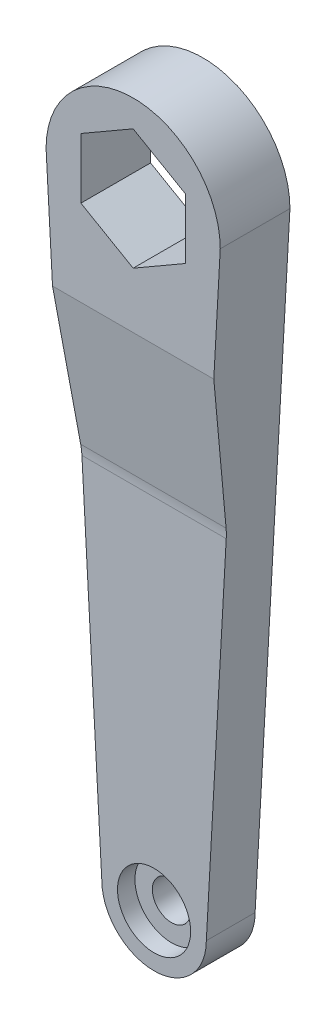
ISO-10303-21;
HEADER;
FILE_DESCRIPTION(('STEP AP214'),'2;1');
FILE_NAME('part.step','',(''),(''),'','','');
FILE_SCHEMA(('AUTOMOTIVE_DESIGN { 1 0 10303 214 1 1 1 1 }'));
ENDSEC;
DATA;
#1=APPLICATION_CONTEXT('core data for automotive mechanical design processes');
#2=APPLICATION_PROTOCOL_DEFINITION('international standard','automotive_design',2000,#1);
#3=PRODUCT_CONTEXT('',#1,'mechanical');
#4=PRODUCT('Part','Part','',(#3));
#5=PRODUCT_RELATED_PRODUCT_CATEGORY('part','',(#4));
#6=PRODUCT_DEFINITION_FORMATION('','',#4);
#7=PRODUCT_DEFINITION_CONTEXT('part definition',#1,'design');
#8=PRODUCT_DEFINITION('design','',#6,#7);
#9=PRODUCT_DEFINITION_SHAPE('','',#8);
#10=(LENGTH_UNIT() NAMED_UNIT(*) SI_UNIT(.MILLI.,.METRE.));
#11=(NAMED_UNIT(*) PLANE_ANGLE_UNIT() SI_UNIT($,.RADIAN.));
#12=(NAMED_UNIT(*) SI_UNIT($,.STERADIAN.) SOLID_ANGLE_UNIT());
#13=UNCERTAINTY_MEASURE_WITH_UNIT(LENGTH_MEASURE(1.E-05),#10,'distance_accuracy_value','');
#14=(GEOMETRIC_REPRESENTATION_CONTEXT(3) GLOBAL_UNCERTAINTY_ASSIGNED_CONTEXT((#13)) GLOBAL_UNIT_ASSIGNED_CONTEXT((#10,
#11,#12)) REPRESENTATION_CONTEXT('',''));
#15=CARTESIAN_POINT('',(0.,0.,0.));
#16=DIRECTION('',(0.,0.,1.));
#17=DIRECTION('',(1.,0.,0.));
#18=AXIS2_PLACEMENT_3D('',#15,#16,#17);
#19=CARTESIAN_POINT('',(0.,-90.,10.));
#20=DIRECTION('',(0.,0.,-1.));
#21=DIRECTION('',(-1.,0.,0.));
#22=AXIS2_PLACEMENT_3D('',#19,#20,#21);
#23=CYLINDRICAL_SURFACE('',#22,2.75);
#24=CARTESIAN_POINT('',(0.,-90.,0.));
#25=DIRECTION('',(0.,0.,1.));
#26=DIRECTION('',(1.,0.,0.));
#27=AXIS2_PLACEMENT_3D('',#24,#25,#26);
#28=CIRCLE('',#27,2.75);
#29=CARTESIAN_POINT('',(2.75,-90.,0.));
#30=VERTEX_POINT('',#29);
#31=EDGE_CURVE('E227',#30,#30,#28,.T.);
#32=ORIENTED_EDGE('',*,*,#31,.F.);
#33=EDGE_LOOP('',(#32));
#34=FACE_BOUND('',#33,.T.);
#35=CARTESIAN_POINT('',(0.,-90.,4.5));
#36=DIRECTION('',(0.,0.,1.));
#37=DIRECTION('',(1.,0.,0.));
#38=AXIS2_PLACEMENT_3D('',#35,#36,#37);
#39=CIRCLE('',#38,2.75);
#40=CARTESIAN_POINT('',(2.75,-90.,4.5));
#41=VERTEX_POINT('',#40);
#42=EDGE_CURVE('E37',#41,#41,#39,.T.);
#43=ORIENTED_EDGE('',*,*,#42,.T.);
#44=EDGE_LOOP('',(#43));
#45=FACE_BOUND('',#44,.T.);
#46=ADVANCED_FACE('F33',(#34,#45),#23,.F.);
#47=CARTESIAN_POINT('',(0.,0.,10.));
#48=DIRECTION('',(0.,0.,1.));
#49=DIRECTION('',(1.,0.,0.));
#50=AXIS2_PLACEMENT_3D('',#47,#48,#49);
#51=PLANE('',#50);
#52=DIRECTION('',(-1.,0.,0.));
#53=VECTOR('',#52,1.);
#54=CARTESIAN_POINT('',(0.,-16.6609919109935,10.));
#55=LINE('',#54,#53);
#56=CARTESIAN_POINT('',(11.5743893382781,-16.6609919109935,10.));
#57=VERTEX_POINT('',#56);
#58=CARTESIAN_POINT('',(-11.5743893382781,-16.6609919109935,10.));
#59=VERTEX_POINT('',#58);
#60=EDGE_CURVE('E133',#57,#59,#55,.T.);
#61=ORIENTED_EDGE('',*,*,#60,.F.);
#62=DIRECTION('',(0.0554700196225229,0.998460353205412,0.));
#63=VECTOR('',#62,1.);
#64=CARTESIAN_POINT('',(12.5,0.,10.));
#65=LINE('',#64,#63);
#66=CARTESIAN_POINT('',(12.5,0.,10.));
#67=VERTEX_POINT('',#66);
#68=EDGE_CURVE('E171',#57,#67,#65,.T.);
#69=ORIENTED_EDGE('',*,*,#68,.T.);
#70=CARTESIAN_POINT('',(0.,0.,10.));
#71=DIRECTION('',(0.,0.,1.));
#72=DIRECTION('',(1.,0.,0.));
#73=AXIS2_PLACEMENT_3D('',#70,#71,#72);
#74=CIRCLE('',#73,12.5);
#75=CARTESIAN_POINT('',(-12.5,0.,10.));
#76=VERTEX_POINT('',#75);
#77=EDGE_CURVE('E179',#67,#76,#74,.T.);
#78=ORIENTED_EDGE('',*,*,#77,.T.);
#79=DIRECTION('',(0.0554700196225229,-0.998460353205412,0.));
#80=VECTOR('',#79,1.);
#81=CARTESIAN_POINT('',(-12.5,0.,10.));
#82=LINE('',#81,#80);
#83=EDGE_CURVE('E176',#76,#59,#82,.T.);
#84=ORIENTED_EDGE('',*,*,#83,.T.);
#85=EDGE_LOOP('',(#61,#69,#78,#84));
#86=FACE_BOUND('',#85,.T.);
#87=DIRECTION('',(-0.866025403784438,0.5,0.));
#88=VECTOR('',#87,1.);
#89=CARTESIAN_POINT('',(7.49999999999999,4.33012701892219,10.));
#90=LINE('',#89,#88);
#91=CARTESIAN_POINT('',(7.49999999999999,4.33012701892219,10.));
#92=VERTEX_POINT('',#91);
#93=CARTESIAN_POINT('',(0.,8.66025403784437,10.));
#94=VERTEX_POINT('',#93);
#95=EDGE_CURVE('E236',#92,#94,#90,.T.);
#96=ORIENTED_EDGE('',*,*,#95,.F.);
#97=DIRECTION('',(0.,1.,0.));
#98=VECTOR('',#97,1.);
#99=CARTESIAN_POINT('',(7.49999999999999,-4.33012701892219,10.));
#100=LINE('',#99,#98);
#101=CARTESIAN_POINT('',(7.49999999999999,-4.33012701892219,10.));
#102=VERTEX_POINT('',#101);
#103=EDGE_CURVE('E211',#102,#92,#100,.T.);
#104=ORIENTED_EDGE('',*,*,#103,.F.);
#105=DIRECTION('',(0.866025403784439,0.5,0.));
#106=VECTOR('',#105,1.);
#107=CARTESIAN_POINT('',(0.,-8.66025403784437,10.));
#108=LINE('',#107,#106);
#109=CARTESIAN_POINT('',(0.,-8.66025403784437,10.));
#110=VERTEX_POINT('',#109);
#111=EDGE_CURVE('E207',#110,#102,#108,.T.);
#112=ORIENTED_EDGE('',*,*,#111,.F.);
#113=DIRECTION('',(0.866025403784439,-0.5,0.));
#114=VECTOR('',#113,1.);
#115=CARTESIAN_POINT('',(-7.49999999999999,-4.33012701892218,10.));
#116=LINE('',#115,#114);
#117=CARTESIAN_POINT('',(-7.49999999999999,-4.33012701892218,10.));
#118=VERTEX_POINT('',#117);
#119=EDGE_CURVE('E229',#118,#110,#116,.T.);
#120=ORIENTED_EDGE('',*,*,#119,.F.);
#121=DIRECTION('',(0.,-1.,0.));
#122=VECTOR('',#121,1.);
#123=CARTESIAN_POINT('',(-7.49999999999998,4.33012701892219,10.));
#124=LINE('',#123,#122);
#125=CARTESIAN_POINT('',(-7.49999999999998,4.33012701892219,10.));
#126=VERTEX_POINT('',#125);
#127=EDGE_CURVE('E232',#126,#118,#124,.T.);
#128=ORIENTED_EDGE('',*,*,#127,.F.);
#129=DIRECTION('',(-0.866025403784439,-0.5,0.));
#130=VECTOR('',#129,1.);
#131=CARTESIAN_POINT('',(0.,8.66025403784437,10.));
#132=LINE('',#131,#130);
#133=EDGE_CURVE('E234',#94,#126,#132,.T.);
#134=ORIENTED_EDGE('',*,*,#133,.F.);
#135=EDGE_LOOP('',(#96,#104,#112,#120,#128,#134));
#136=FACE_BOUND('',#135,.T.);
#137=ADVANCED_FACE('F265',(#86,#136),#51,.T.);
#138=CARTESIAN_POINT('',(0.,0.,0.));
#139=DIRECTION('',(0.,0.,1.));
#140=DIRECTION('',(1.,0.,0.));
#141=AXIS2_PLACEMENT_3D('',#138,#139,#140);
#142=PLANE('',#141);
#143=CARTESIAN_POINT('',(0.,0.,0.));
#144=DIRECTION('',(0.,0.,1.));
#145=DIRECTION('',(1.,0.,0.));
#146=AXIS2_PLACEMENT_3D('',#143,#144,#145);
#147=CIRCLE('',#146,12.5);
#148=CARTESIAN_POINT('',(12.5,0.,0.));
#149=VERTEX_POINT('',#148);
#150=CARTESIAN_POINT('',(-12.5,0.,0.));
#151=VERTEX_POINT('',#150);
#152=EDGE_CURVE('E183',#149,#151,#147,.T.);
#153=ORIENTED_EDGE('',*,*,#152,.F.);
#154=DIRECTION('',(0.0554700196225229,0.998460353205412,0.));
#155=VECTOR('',#154,1.);
#156=CARTESIAN_POINT('',(12.5,0.,0.));
#157=LINE('',#156,#155);
#158=CARTESIAN_POINT('',(7.5,-90.,0.));
#159=VERTEX_POINT('',#158);
#160=EDGE_CURVE('E190',#159,#149,#157,.T.);
#161=ORIENTED_EDGE('',*,*,#160,.F.);
#162=CARTESIAN_POINT('',(0.,-90.,0.));
#163=DIRECTION('',(0.,0.,1.));
#164=DIRECTION('',(1.,0.,0.));
#165=AXIS2_PLACEMENT_3D('',#162,#163,#164);
#166=CIRCLE('',#165,7.5);
#167=CARTESIAN_POINT('',(-7.5,-90.,0.));
#168=VERTEX_POINT('',#167);
#169=EDGE_CURVE('E188',#168,#159,#166,.T.);
#170=ORIENTED_EDGE('',*,*,#169,.F.);
#171=DIRECTION('',(0.0554700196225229,-0.998460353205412,0.));
#172=VECTOR('',#171,1.);
#173=CARTESIAN_POINT('',(-12.5,0.,0.));
#174=LINE('',#173,#172);
#175=EDGE_CURVE('E145',#151,#168,#174,.T.);
#176=ORIENTED_EDGE('',*,*,#175,.F.);
#177=EDGE_LOOP('',(#153,#161,#170,#176));
#178=FACE_BOUND('',#177,.T.);
#179=DIRECTION('',(0.,1.,0.));
#180=VECTOR('',#179,1.);
#181=CARTESIAN_POINT('',(7.49999999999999,-4.33012701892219,0.));
#182=LINE('',#181,#180);
#183=CARTESIAN_POINT('',(7.49999999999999,-4.33012701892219,0.));
#184=VERTEX_POINT('',#183);
#185=CARTESIAN_POINT('',(7.49999999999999,4.33012701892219,0.));
#186=VERTEX_POINT('',#185);
#187=EDGE_CURVE('E224',#184,#186,#182,.T.);
#188=ORIENTED_EDGE('',*,*,#187,.T.);
#189=DIRECTION('',(-0.866025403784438,0.5,0.));
#190=VECTOR('',#189,1.);
#191=CARTESIAN_POINT('',(7.49999999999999,4.33012701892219,0.));
#192=LINE('',#191,#190);
#193=CARTESIAN_POINT('',(0.,8.66025403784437,0.));
#194=VERTEX_POINT('',#193);
#195=EDGE_CURVE('E221',#186,#194,#192,.T.);
#196=ORIENTED_EDGE('',*,*,#195,.T.);
#197=DIRECTION('',(-0.866025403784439,-0.5,0.));
#198=VECTOR('',#197,1.);
#199=CARTESIAN_POINT('',(0.,8.66025403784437,0.));
#200=LINE('',#199,#198);
#201=CARTESIAN_POINT('',(-7.49999999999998,4.33012701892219,0.));
#202=VERTEX_POINT('',#201);
#203=EDGE_CURVE('E218',#194,#202,#200,.T.);
#204=ORIENTED_EDGE('',*,*,#203,.T.);
#205=DIRECTION('',(0.,-1.,0.));
#206=VECTOR('',#205,1.);
#207=CARTESIAN_POINT('',(-7.49999999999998,4.33012701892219,0.));
#208=LINE('',#207,#206);
#209=CARTESIAN_POINT('',(-7.49999999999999,-4.33012701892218,0.));
#210=VERTEX_POINT('',#209);
#211=EDGE_CURVE('E215',#202,#210,#208,.T.);
#212=ORIENTED_EDGE('',*,*,#211,.T.);
#213=DIRECTION('',(0.866025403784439,-0.5,0.));
#214=VECTOR('',#213,1.);
#215=CARTESIAN_POINT('',(-7.49999999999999,-4.33012701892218,0.));
#216=LINE('',#215,#214);
#217=CARTESIAN_POINT('',(0.,-8.66025403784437,0.));
#218=VERTEX_POINT('',#217);
#219=EDGE_CURVE('E212',#210,#218,#216,.T.);
#220=ORIENTED_EDGE('',*,*,#219,.T.);
#221=DIRECTION('',(0.866025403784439,0.5,0.));
#222=VECTOR('',#221,1.);
#223=CARTESIAN_POINT('',(0.,-8.66025403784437,0.));
#224=LINE('',#223,#222);
#225=EDGE_CURVE('E208',#218,#184,#224,.T.);
#226=ORIENTED_EDGE('',*,*,#225,.T.);
#227=EDGE_LOOP('',(#188,#196,#204,#212,#220,#226));
#228=FACE_BOUND('',#227,.T.);
#229=ORIENTED_EDGE('',*,*,#31,.T.);
#230=EDGE_LOOP('',(#229));
#231=FACE_BOUND('',#230,.T.);
#232=ADVANCED_FACE('F271',(#178,#228,#231),#142,.F.);
#233=CARTESIAN_POINT('',(0.,0.,10.));
#234=DIRECTION('',(0.,0.,-1.));
#235=DIRECTION('',(-1.,0.,0.));
#236=AXIS2_PLACEMENT_3D('',#233,#234,#235);
#237=CYLINDRICAL_SURFACE('',#236,12.5);
#238=ORIENTED_EDGE('',*,*,#152,.T.);
#239=DIRECTION('',(0.,0.,-1.));
#240=VECTOR('',#239,1.);
#241=CARTESIAN_POINT('',(-12.5,0.,10.));
#242=LINE('',#241,#240);
#243=EDGE_CURVE('E147',#76,#151,#242,.T.);
#244=ORIENTED_EDGE('',*,*,#243,.F.);
#245=ORIENTED_EDGE('',*,*,#77,.F.);
#246=DIRECTION('',(0.,0.,-1.));
#247=VECTOR('',#246,1.);
#248=CARTESIAN_POINT('',(12.5,0.,10.));
#249=LINE('',#248,#247);
#250=EDGE_CURVE('E151',#67,#149,#249,.T.);
#251=ORIENTED_EDGE('',*,*,#250,.T.);
#252=EDGE_LOOP('',(#238,#244,#245,#251));
#253=FACE_BOUND('',#252,.T.);
#254=ADVANCED_FACE('F303',(#253),#237,.T.);
#255=CARTESIAN_POINT('',(-12.5,0.,10.));
#256=DIRECTION('',(0.998460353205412,0.0554700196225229,0.));
#257=DIRECTION('',(-0.0554700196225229,0.998460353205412,0.));
#258=AXIS2_PLACEMENT_3D('',#255,#256,#257);
#259=PLANE('',#258);
#260=DIRECTION('',(-0.0554700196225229,0.998460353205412,0.));
#261=VECTOR('',#260,1.);
#262=CARTESIAN_POINT('',(-12.5,0.,7.));
#263=LINE('',#262,#261);
#264=CARTESIAN_POINT('',(-7.5,-90.,7.));
#265=VERTEX_POINT('',#264);
#266=CARTESIAN_POINT('',(-10.3552677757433,-38.6051800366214,7.));
#267=VERTEX_POINT('',#266);
#268=EDGE_CURVE('E125',#265,#267,#263,.T.);
#269=ORIENTED_EDGE('',*,*,#268,.T.);
#270=CARTESIAN_POINT('',(-10.3552677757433,-38.6051800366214,17.));
#271=DIRECTION('',(0.998460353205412,0.0554700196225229,0.));
#272=DIRECTION('',(-0.0554700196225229,0.998460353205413,0.));
#273=AXIS2_PLACEMENT_3D('',#270,#271,#272);
#274=ELLIPSE('',#273,10.0154202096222,10.);
#275=CARTESIAN_POINT('',(-10.4329594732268,-37.2067294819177,7.09826600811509));
#276=VERTEX_POINT('',#275);
#277=EDGE_CURVE('E11',#267,#276,#274,.T.);
#278=ORIENTED_EDGE('',*,*,#277,.T.);
#279=DIRECTION('',(-0.0549265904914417,0.988678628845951,0.139633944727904));
#280=VECTOR('',#279,1.);
#281=CARTESIAN_POINT('',(-12.4819527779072,-0.324849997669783,12.3072006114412));
#282=LINE('',#281,#280);
#283=EDGE_CURVE('E166',#276,#59,#282,.T.);
#284=ORIENTED_EDGE('',*,*,#283,.T.);
#285=ORIENTED_EDGE('',*,*,#83,.F.);
#286=ORIENTED_EDGE('',*,*,#243,.T.);
#287=ORIENTED_EDGE('',*,*,#175,.T.);
#288=DIRECTION('',(0.,0.,-1.));
#289=VECTOR('',#288,1.);
#290=CARTESIAN_POINT('',(-7.5,-90.,10.));
#291=LINE('',#290,#289);
#292=EDGE_CURVE('E138',#265,#168,#291,.T.);
#293=ORIENTED_EDGE('',*,*,#292,.F.);
#294=EDGE_LOOP('',(#269,#278,#284,#285,#286,#287,#293));
#295=FACE_BOUND('',#294,.T.);
#296=ADVANCED_FACE('F143',(#295),#259,.F.);
#297=CARTESIAN_POINT('',(0.,-90.,10.));
#298=DIRECTION('',(0.,0.,-1.));
#299=DIRECTION('',(-1.,0.,0.));
#300=AXIS2_PLACEMENT_3D('',#297,#298,#299);
#301=CYLINDRICAL_SURFACE('',#300,7.5);
#302=DIRECTION('',(0.,0.,-1.));
#303=VECTOR('',#302,1.);
#304=CARTESIAN_POINT('',(7.5,-90.,10.));
#305=LINE('',#304,#303);
#306=CARTESIAN_POINT('',(7.5,-90.,7.));
#307=VERTEX_POINT('',#306);
#308=EDGE_CURVE('E140',#307,#159,#305,.T.);
#309=ORIENTED_EDGE('',*,*,#308,.F.);
#310=CARTESIAN_POINT('',(0.,-90.,7.));
#311=DIRECTION('',(0.,0.,-1.));
#312=DIRECTION('',(0.,1.,0.));
#313=AXIS2_PLACEMENT_3D('',#310,#311,#312);
#314=CIRCLE('',#313,7.5);
#315=EDGE_CURVE('E128',#307,#265,#314,.T.);
#316=ORIENTED_EDGE('',*,*,#315,.T.);
#317=ORIENTED_EDGE('',*,*,#292,.T.);
#318=ORIENTED_EDGE('',*,*,#169,.T.);
#319=EDGE_LOOP('',(#309,#316,#317,#318));
#320=FACE_BOUND('',#319,.T.);
#321=ADVANCED_FACE('F136',(#320),#301,.T.);
#322=CARTESIAN_POINT('',(12.5,0.,10.));
#323=DIRECTION('',(-0.998460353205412,0.0554700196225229,0.));
#324=DIRECTION('',(-0.0554700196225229,-0.998460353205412,0.));
#325=AXIS2_PLACEMENT_3D('',#322,#323,#324);
#326=PLANE('',#325);
#327=ORIENTED_EDGE('',*,*,#68,.F.);
#328=DIRECTION('',(-0.0549265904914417,-0.988678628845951,-0.139633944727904));
#329=VECTOR('',#328,1.);
#330=CARTESIAN_POINT('',(12.4819527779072,-0.324849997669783,12.3072006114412));
#331=LINE('',#330,#329);
#332=CARTESIAN_POINT('',(10.4329594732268,-37.2067294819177,7.09826600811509));
#333=VERTEX_POINT('',#332);
#334=EDGE_CURVE('E149',#57,#333,#331,.T.);
#335=ORIENTED_EDGE('',*,*,#334,.T.);
#336=CARTESIAN_POINT('',(10.3552677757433,-38.6051800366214,17.));
#337=DIRECTION('',(-0.998460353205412,0.0554700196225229,0.));
#338=DIRECTION('',(-0.0554700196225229,-0.998460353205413,0.));
#339=AXIS2_PLACEMENT_3D('',#336,#337,#338);
#340=ELLIPSE('',#339,10.0154202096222,10.);
#341=CARTESIAN_POINT('',(10.3552677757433,-38.6051800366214,7.));
#342=VERTEX_POINT('',#341);
#343=EDGE_CURVE('E42',#333,#342,#340,.T.);
#344=ORIENTED_EDGE('',*,*,#343,.T.);
#345=DIRECTION('',(-0.0554700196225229,-0.998460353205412,0.));
#346=VECTOR('',#345,1.);
#347=CARTESIAN_POINT('',(12.5,0.,7.));
#348=LINE('',#347,#346);
#349=EDGE_CURVE('E141',#342,#307,#348,.T.);
#350=ORIENTED_EDGE('',*,*,#349,.T.);
#351=ORIENTED_EDGE('',*,*,#308,.T.);
#352=ORIENTED_EDGE('',*,*,#160,.T.);
#353=ORIENTED_EDGE('',*,*,#250,.F.);
#354=EDGE_LOOP('',(#327,#335,#344,#350,#351,#352,#353));
#355=FACE_BOUND('',#354,.T.);
#356=ADVANCED_FACE('F169',(#355),#326,.F.);
#357=CARTESIAN_POINT('',(7.49999999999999,-4.33012701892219,10.));
#358=DIRECTION('',(-1.,0.,0.));
#359=DIRECTION('',(0.,-1.,0.));
#360=AXIS2_PLACEMENT_3D('',#357,#358,#359);
#361=PLANE('',#360);
#362=ORIENTED_EDGE('',*,*,#187,.F.);
#363=DIRECTION('',(0.,0.,-1.));
#364=VECTOR('',#363,1.);
#365=CARTESIAN_POINT('',(7.49999999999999,-4.33012701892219,10.));
#366=LINE('',#365,#364);
#367=EDGE_CURVE('E204',#102,#184,#366,.T.);
#368=ORIENTED_EDGE('',*,*,#367,.F.);
#369=ORIENTED_EDGE('',*,*,#103,.T.);
#370=DIRECTION('',(0.,0.,-1.));
#371=VECTOR('',#370,1.);
#372=CARTESIAN_POINT('',(7.49999999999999,4.33012701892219,10.));
#373=LINE('',#372,#371);
#374=EDGE_CURVE('E186',#92,#186,#373,.T.);
#375=ORIENTED_EDGE('',*,*,#374,.T.);
#376=EDGE_LOOP('',(#362,#368,#369,#375));
#377=FACE_BOUND('',#376,.T.);
#378=ADVANCED_FACE('F296',(#377),#361,.T.);
#379=CARTESIAN_POINT('',(7.49999999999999,4.33012701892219,10.));
#380=DIRECTION('',(-0.5,-0.866025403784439,0.));
#381=DIRECTION('',(0.866025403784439,-0.5,0.));
#382=AXIS2_PLACEMENT_3D('',#379,#380,#381);
#383=PLANE('',#382);
#384=ORIENTED_EDGE('',*,*,#195,.F.);
#385=ORIENTED_EDGE('',*,*,#374,.F.);
#386=ORIENTED_EDGE('',*,*,#95,.T.);
#387=DIRECTION('',(0.,0.,-1.));
#388=VECTOR('',#387,1.);
#389=CARTESIAN_POINT('',(0.,8.66025403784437,10.));
#390=LINE('',#389,#388);
#391=EDGE_CURVE('E196',#94,#194,#390,.T.);
#392=ORIENTED_EDGE('',*,*,#391,.T.);
#393=EDGE_LOOP('',(#384,#385,#386,#392));
#394=FACE_BOUND('',#393,.T.);
#395=ADVANCED_FACE('F292',(#394),#383,.T.);
#396=CARTESIAN_POINT('',(0.,8.66025403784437,10.));
#397=DIRECTION('',(0.5,-0.866025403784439,0.));
#398=DIRECTION('',(0.866025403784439,0.5,0.));
#399=AXIS2_PLACEMENT_3D('',#396,#397,#398);
#400=PLANE('',#399);
#401=ORIENTED_EDGE('',*,*,#203,.F.);
#402=ORIENTED_EDGE('',*,*,#391,.F.);
#403=ORIENTED_EDGE('',*,*,#133,.T.);
#404=DIRECTION('',(0.,0.,-1.));
#405=VECTOR('',#404,1.);
#406=CARTESIAN_POINT('',(-7.49999999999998,4.33012701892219,10.));
#407=LINE('',#406,#405);
#408=EDGE_CURVE('E198',#126,#202,#407,.T.);
#409=ORIENTED_EDGE('',*,*,#408,.T.);
#410=EDGE_LOOP('',(#401,#402,#403,#409));
#411=FACE_BOUND('',#410,.T.);
#412=ADVANCED_FACE('F288',(#411),#400,.T.);
#413=CARTESIAN_POINT('',(-7.49999999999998,4.33012701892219,10.));
#414=DIRECTION('',(1.,0.,0.));
#415=DIRECTION('',(0.,1.,0.));
#416=AXIS2_PLACEMENT_3D('',#413,#414,#415);
#417=PLANE('',#416);
#418=ORIENTED_EDGE('',*,*,#211,.F.);
#419=ORIENTED_EDGE('',*,*,#408,.F.);
#420=ORIENTED_EDGE('',*,*,#127,.T.);
#421=DIRECTION('',(0.,0.,-1.));
#422=VECTOR('',#421,1.);
#423=CARTESIAN_POINT('',(-7.49999999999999,-4.33012701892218,10.));
#424=LINE('',#423,#422);
#425=EDGE_CURVE('E200',#118,#210,#424,.T.);
#426=ORIENTED_EDGE('',*,*,#425,.T.);
#427=EDGE_LOOP('',(#418,#419,#420,#426));
#428=FACE_BOUND('',#427,.T.);
#429=ADVANCED_FACE('F284',(#428),#417,.T.);
#430=CARTESIAN_POINT('',(-7.49999999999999,-4.33012701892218,10.));
#431=DIRECTION('',(0.5,0.866025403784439,0.));
#432=DIRECTION('',(-0.866025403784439,0.5,0.));
#433=AXIS2_PLACEMENT_3D('',#430,#431,#432);
#434=PLANE('',#433);
#435=ORIENTED_EDGE('',*,*,#219,.F.);
#436=ORIENTED_EDGE('',*,*,#425,.F.);
#437=ORIENTED_EDGE('',*,*,#119,.T.);
#438=DIRECTION('',(0.,0.,-1.));
#439=VECTOR('',#438,1.);
#440=CARTESIAN_POINT('',(0.,-8.66025403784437,10.));
#441=LINE('',#440,#439);
#442=EDGE_CURVE('E202',#110,#218,#441,.T.);
#443=ORIENTED_EDGE('',*,*,#442,.T.);
#444=EDGE_LOOP('',(#435,#436,#437,#443));
#445=FACE_BOUND('',#444,.T.);
#446=ADVANCED_FACE('F280',(#445),#434,.T.);
#447=CARTESIAN_POINT('',(0.,-8.66025403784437,10.));
#448=DIRECTION('',(-0.5,0.866025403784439,0.));
#449=DIRECTION('',(-0.866025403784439,-0.5,0.));
#450=AXIS2_PLACEMENT_3D('',#447,#448,#449);
#451=PLANE('',#450);
#452=ORIENTED_EDGE('',*,*,#225,.F.);
#453=ORIENTED_EDGE('',*,*,#442,.F.);
#454=ORIENTED_EDGE('',*,*,#111,.T.);
#455=ORIENTED_EDGE('',*,*,#367,.T.);
#456=EDGE_LOOP('',(#452,#453,#454,#455));
#457=FACE_BOUND('',#456,.T.);
#458=ADVANCED_FACE('F277',(#457),#451,.T.);
#459=CARTESIAN_POINT('',(-12.5,-37.9025022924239,7.));
#460=DIRECTION('',(0.,0.139845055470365,-0.990173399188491));
#461=DIRECTION('',(0.,0.990173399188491,0.139845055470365));
#462=AXIS2_PLACEMENT_3D('',#459,#460,#461);
#463=PLANE('',#462);
#464=ORIENTED_EDGE('',*,*,#283,.F.);
#465=DIRECTION('',(1.,0.,0.));
#466=VECTOR('',#465,1.);
#467=CARTESIAN_POINT('',(10.3943054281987,-37.2067294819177,7.09826600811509));
#468=LINE('',#467,#466);
#469=EDGE_CURVE('E156',#276,#333,#468,.T.);
#470=ORIENTED_EDGE('',*,*,#469,.T.);
#471=ORIENTED_EDGE('',*,*,#334,.F.);
#472=ORIENTED_EDGE('',*,*,#60,.T.);
#473=EDGE_LOOP('',(#464,#470,#471,#472));
#474=FACE_BOUND('',#473,.T.);
#475=ADVANCED_FACE('F163',(#474),#463,.F.);
#476=CARTESIAN_POINT('',(-12.5,-117.102021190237,7.));
#477=DIRECTION('',(0.,0.,-1.));
#478=DIRECTION('',(0.,1.,0.));
#479=AXIS2_PLACEMENT_3D('',#476,#477,#478);
#480=PLANE('',#479);
#481=CARTESIAN_POINT('',(0.,-90.,7.));
#482=DIRECTION('',(0.,0.,1.));
#483=DIRECTION('',(1.,0.,0.));
#484=AXIS2_PLACEMENT_3D('',#481,#482,#483);
#485=CIRCLE('',#484,5.25);
#486=CARTESIAN_POINT('',(5.25,-90.,7.));
#487=VERTEX_POINT('',#486);
#488=EDGE_CURVE('E244',#487,#487,#485,.T.);
#489=ORIENTED_EDGE('',*,*,#488,.F.);
#490=EDGE_LOOP('',(#489));
#491=FACE_BOUND('',#490,.T.);
#492=ORIENTED_EDGE('',*,*,#349,.F.);
#493=DIRECTION('',(1.,0.,0.));
#494=VECTOR('',#493,1.);
#495=CARTESIAN_POINT('',(-10.3943054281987,-38.6051800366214,7.));
#496=LINE('',#495,#494);
#497=EDGE_CURVE('E49',#342,#267,#496,.F.);
#498=ORIENTED_EDGE('',*,*,#497,.T.);
#499=ORIENTED_EDGE('',*,*,#268,.F.);
#500=ORIENTED_EDGE('',*,*,#315,.F.);
#501=EDGE_LOOP('',(#492,#498,#499,#500));
#502=FACE_BOUND('',#501,.T.);
#503=ADVANCED_FACE('F127',(#491,#502),#480,.F.);
#504=CARTESIAN_POINT('',(-12.5,-38.6051800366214,17.));
#505=DIRECTION('',(-1.,0.,0.));
#506=DIRECTION('',(0.,0.,1.));
#507=AXIS2_PLACEMENT_3D('',#504,#505,#506);
#508=CYLINDRICAL_SURFACE('',#507,10.);
#509=ORIENTED_EDGE('',*,*,#277,.F.);
#510=ORIENTED_EDGE('',*,*,#497,.F.);
#511=ORIENTED_EDGE('',*,*,#343,.F.);
#512=ORIENTED_EDGE('',*,*,#469,.F.);
#513=EDGE_LOOP('',(#509,#510,#511,#512));
#514=FACE_BOUND('',#513,.T.);
#515=ADVANCED_FACE('F35',(#514),#508,.F.);
#516=CARTESIAN_POINT('',(0.,-90.,4.5));
#517=DIRECTION('',(0.,0.,1.));
#518=DIRECTION('',(1.,0.,0.));
#519=AXIS2_PLACEMENT_3D('',#516,#517,#518);
#520=CYLINDRICAL_SURFACE('',#519,5.25);
#521=CARTESIAN_POINT('',(0.,-90.,4.5));
#522=DIRECTION('',(0.,0.,1.));
#523=DIRECTION('',(1.,0.,0.));
#524=AXIS2_PLACEMENT_3D('',#521,#522,#523);
#525=CIRCLE('',#524,5.25);
#526=CARTESIAN_POINT('',(5.25,-90.,4.5));
#527=VERTEX_POINT('',#526);
#528=EDGE_CURVE('E247',#527,#527,#525,.T.);
#529=ORIENTED_EDGE('',*,*,#528,.F.);
#530=EDGE_LOOP('',(#529));
#531=FACE_BOUND('',#530,.T.);
#532=ORIENTED_EDGE('',*,*,#488,.T.);
#533=EDGE_LOOP('',(#532));
#534=FACE_BOUND('',#533,.T.);
#535=ADVANCED_FACE('F257',(#531,#534),#520,.F.);
#536=CARTESIAN_POINT('',(0.,-90.,4.5));
#537=DIRECTION('',(0.,0.,1.));
#538=DIRECTION('',(1.,0.,0.));
#539=AXIS2_PLACEMENT_3D('',#536,#537,#538);
#540=PLANE('',#539);
#541=ORIENTED_EDGE('',*,*,#42,.F.);
#542=EDGE_LOOP('',(#541));
#543=FACE_BOUND('',#542,.T.);
#544=ORIENTED_EDGE('',*,*,#528,.T.);
#545=EDGE_LOOP('',(#544));
#546=FACE_BOUND('',#545,.T.);
#547=ADVANCED_FACE('F255',(#543,#546),#540,.T.);
#548=CLOSED_SHELL('',(#46,#137,#232,#254,#296,#321,#356,#378,#395,#412,#429,#446,#458,#475,#503,
#515,#535,#547));
#549=MANIFOLD_SOLID_BREP('B2',#548);
#550=ADVANCED_BREP_SHAPE_REPRESENTATION('',(#18,#549),#14);
#551=SHAPE_DEFINITION_REPRESENTATION(#9,#550);
ENDSEC;
END-ISO-10303-21;
